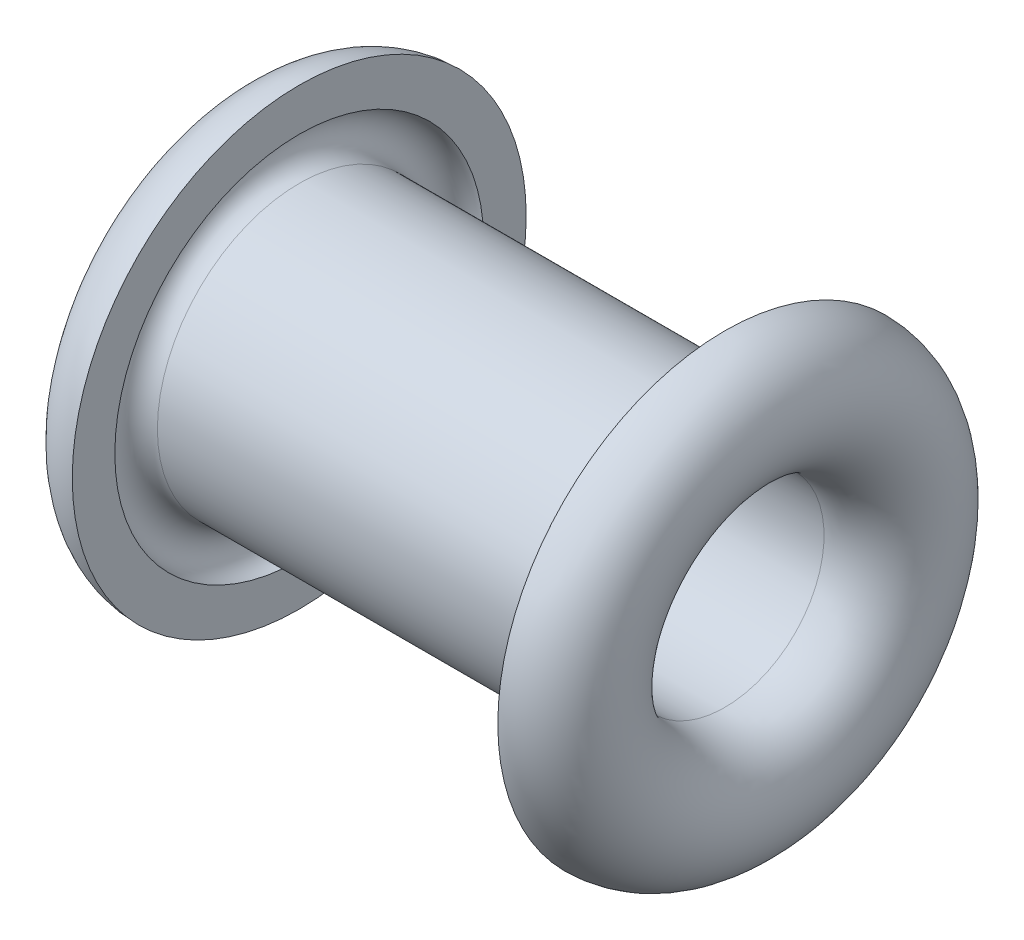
ISO-10303-21;
HEADER;
FILE_DESCRIPTION(('STEP AP214'),'2;1');
FILE_NAME('part.step','',(''),(''),'','','');
FILE_SCHEMA(('AUTOMOTIVE_DESIGN { 1 0 10303 214 1 1 1 1 }'));
ENDSEC;
DATA;
#1=APPLICATION_CONTEXT('core data for automotive mechanical design processes');
#2=APPLICATION_PROTOCOL_DEFINITION('international standard','automotive_design',2000,#1);
#3=PRODUCT_CONTEXT('',#1,'mechanical');
#4=PRODUCT('Part','Part','',(#3));
#5=PRODUCT_RELATED_PRODUCT_CATEGORY('part','',(#4));
#6=PRODUCT_DEFINITION_FORMATION('','',#4);
#7=PRODUCT_DEFINITION_CONTEXT('part definition',#1,'design');
#8=PRODUCT_DEFINITION('design','',#6,#7);
#9=PRODUCT_DEFINITION_SHAPE('','',#8);
#10=(LENGTH_UNIT() NAMED_UNIT(*) SI_UNIT(.MILLI.,.METRE.));
#11=(NAMED_UNIT(*) PLANE_ANGLE_UNIT() SI_UNIT($,.RADIAN.));
#12=(NAMED_UNIT(*) SI_UNIT($,.STERADIAN.) SOLID_ANGLE_UNIT());
#13=UNCERTAINTY_MEASURE_WITH_UNIT(LENGTH_MEASURE(1.E-05),#10,'distance_accuracy_value','');
#14=(GEOMETRIC_REPRESENTATION_CONTEXT(3) GLOBAL_UNCERTAINTY_ASSIGNED_CONTEXT((#13)) GLOBAL_UNIT_ASSIGNED_CONTEXT((#10,
#11,#12)) REPRESENTATION_CONTEXT('',''));
#15=CARTESIAN_POINT('',(0.,0.,0.));
#16=DIRECTION('',(0.,0.,1.));
#17=DIRECTION('',(1.,0.,0.));
#18=AXIS2_PLACEMENT_3D('',#15,#16,#17);
#19=CARTESIAN_POINT('',(0.,0.,0.));
#20=DIRECTION('',(-1.,0.,0.));
#21=DIRECTION('',(0.,0.,1.));
#22=AXIS2_PLACEMENT_3D('',#19,#20,#21);
#23=TOROIDAL_SURFACE('',#22,1.15,0.45);
#24=CARTESIAN_POINT('',(0.,0.,0.));
#25=DIRECTION('',(-1.,0.,0.));
#26=DIRECTION('',(0.,0.,1.));
#27=AXIS2_PLACEMENT_3D('',#24,#25,#26);
#28=CIRCLE('',#27,0.7);
#29=CARTESIAN_POINT('',(0.,0.,0.7));
#30=VERTEX_POINT('',#29);
#31=EDGE_CURVE('E10',#30,#30,#28,.T.);
#32=ORIENTED_EDGE('',*,*,#31,.F.);
#33=EDGE_LOOP('',(#32));
#34=FACE_BOUND('',#33,.T.);
#35=CARTESIAN_POINT('',(0.,0.,0.));
#36=DIRECTION('',(-1.,0.,0.));
#37=DIRECTION('',(0.,0.,1.));
#38=AXIS2_PLACEMENT_3D('',#35,#36,#37);
#39=CIRCLE('',#38,1.6);
#40=CARTESIAN_POINT('',(0.,0.,1.6));
#41=VERTEX_POINT('',#40);
#42=EDGE_CURVE('E45',#41,#41,#39,.T.);
#43=ORIENTED_EDGE('',*,*,#42,.T.);
#44=EDGE_LOOP('',(#43));
#45=FACE_BOUND('',#44,.T.);
#46=ADVANCED_FACE('F30',(#34,#45),#23,.T.);
#47=CARTESIAN_POINT('',(0.,0.,0.));
#48=DIRECTION('',(-1.,0.,0.));
#49=DIRECTION('',(0.,0.,1.));
#50=AXIS2_PLACEMENT_3D('',#47,#48,#49);
#51=CYLINDRICAL_SURFACE('',#50,0.7);
#52=ORIENTED_EDGE('',*,*,#31,.T.);
#53=EDGE_LOOP('',(#52));
#54=FACE_BOUND('',#53,.T.);
#55=CARTESIAN_POINT('',(3.,0.,0.));
#56=DIRECTION('',(-1.,0.,0.));
#57=DIRECTION('',(0.,0.,1.));
#58=AXIS2_PLACEMENT_3D('',#55,#56,#57);
#59=CIRCLE('',#58,0.7);
#60=CARTESIAN_POINT('',(3.,0.,0.7));
#61=VERTEX_POINT('',#60);
#62=EDGE_CURVE('E50',#61,#61,#59,.T.);
#63=ORIENTED_EDGE('',*,*,#62,.F.);
#64=EDGE_LOOP('',(#63));
#65=FACE_BOUND('',#64,.T.);
#66=ADVANCED_FACE('F88',(#54,#65),#51,.F.);
#67=CARTESIAN_POINT('',(0.,0.,0.));
#68=DIRECTION('',(-1.,0.,0.));
#69=DIRECTION('',(0.,0.,1.));
#70=AXIS2_PLACEMENT_3D('',#67,#68,#69);
#71=CYLINDRICAL_SURFACE('',#70,1.);
#72=CARTESIAN_POINT('',(0.,0.,0.));
#73=DIRECTION('',(-1.,0.,0.));
#74=DIRECTION('',(0.,0.,1.));
#75=AXIS2_PLACEMENT_3D('',#72,#73,#74);
#76=CIRCLE('',#75,1.);
#77=CARTESIAN_POINT('',(0.,0.,1.));
#78=VERTEX_POINT('',#77);
#79=EDGE_CURVE('E36',#78,#78,#76,.T.);
#80=ORIENTED_EDGE('',*,*,#79,.F.);
#81=EDGE_LOOP('',(#80));
#82=FACE_BOUND('',#81,.T.);
#83=CARTESIAN_POINT('',(3.,0.,0.));
#84=DIRECTION('',(-1.,0.,0.));
#85=DIRECTION('',(0.,0.,1.));
#86=AXIS2_PLACEMENT_3D('',#83,#84,#85);
#87=CIRCLE('',#86,1.);
#88=CARTESIAN_POINT('',(3.,0.,1.));
#89=VERTEX_POINT('',#88);
#90=EDGE_CURVE('E54',#89,#89,#87,.T.);
#91=ORIENTED_EDGE('',*,*,#90,.T.);
#92=EDGE_LOOP('',(#91));
#93=FACE_BOUND('',#92,.T.);
#94=ADVANCED_FACE('F93',(#82,#93),#71,.T.);
#95=CARTESIAN_POINT('',(0.,0.,0.));
#96=DIRECTION('',(-1.,0.,0.));
#97=DIRECTION('',(0.,0.,1.));
#98=AXIS2_PLACEMENT_3D('',#95,#96,#97);
#99=TOROIDAL_SURFACE('',#98,1.15,0.15);
#100=CARTESIAN_POINT('',(0.,0.,0.));
#101=DIRECTION('',(-1.,0.,0.));
#102=DIRECTION('',(0.,0.,1.));
#103=AXIS2_PLACEMENT_3D('',#100,#101,#102);
#104=CIRCLE('',#103,1.3);
#105=CARTESIAN_POINT('',(0.,0.,1.3));
#106=VERTEX_POINT('',#105);
#107=EDGE_CURVE('E40',#106,#106,#104,.T.);
#108=ORIENTED_EDGE('',*,*,#107,.F.);
#109=EDGE_LOOP('',(#108));
#110=FACE_BOUND('',#109,.T.);
#111=ORIENTED_EDGE('',*,*,#79,.T.);
#112=EDGE_LOOP('',(#111));
#113=FACE_BOUND('',#112,.T.);
#114=ADVANCED_FACE('F84',(#110,#113),#99,.F.);
#115=CARTESIAN_POINT('',(0.,1.6,0.));
#116=DIRECTION('',(-1.,0.,0.));
#117=DIRECTION('',(0.,0.,1.));
#118=AXIS2_PLACEMENT_3D('',#115,#116,#117);
#119=PLANE('',#118);
#120=ORIENTED_EDGE('',*,*,#42,.F.);
#121=EDGE_LOOP('',(#120));
#122=FACE_BOUND('',#121,.T.);
#123=ORIENTED_EDGE('',*,*,#107,.T.);
#124=EDGE_LOOP('',(#123));
#125=FACE_BOUND('',#124,.T.);
#126=ADVANCED_FACE('F75',(#122,#125),#119,.F.);
#127=CARTESIAN_POINT('',(3.,0.,0.));
#128=DIRECTION('',(1.,0.,0.));
#129=DIRECTION('',(0.,0.,1.));
#130=AXIS2_PLACEMENT_3D('',#127,#128,#129);
#131=TOROIDAL_SURFACE('',#130,1.15,0.45);
#132=ORIENTED_EDGE('',*,*,#62,.T.);
#133=EDGE_LOOP('',(#132));
#134=FACE_BOUND('',#133,.T.);
#135=CARTESIAN_POINT('',(3.,0.,0.));
#136=DIRECTION('',(-1.,0.,0.));
#137=DIRECTION('',(0.,0.,1.));
#138=AXIS2_PLACEMENT_3D('',#135,#136,#137);
#139=CIRCLE('',#138,1.6);
#140=CARTESIAN_POINT('',(3.,0.,1.6));
#141=VERTEX_POINT('',#140);
#142=EDGE_CURVE('E60',#141,#141,#139,.T.);
#143=ORIENTED_EDGE('',*,*,#142,.F.);
#144=EDGE_LOOP('',(#143));
#145=FACE_BOUND('',#144,.T.);
#146=ADVANCED_FACE('F72',(#134,#145),#131,.T.);
#147=CARTESIAN_POINT('',(3.,0.,0.));
#148=DIRECTION('',(1.,0.,0.));
#149=DIRECTION('',(0.,0.,1.));
#150=AXIS2_PLACEMENT_3D('',#147,#148,#149);
#151=TOROIDAL_SURFACE('',#150,1.15,0.15);
#152=CARTESIAN_POINT('',(3.,0.,0.));
#153=DIRECTION('',(-1.,0.,0.));
#154=DIRECTION('',(0.,0.,1.));
#155=AXIS2_PLACEMENT_3D('',#152,#153,#154);
#156=CIRCLE('',#155,1.3);
#157=CARTESIAN_POINT('',(3.,0.,1.3));
#158=VERTEX_POINT('',#157);
#159=EDGE_CURVE('E57',#158,#158,#156,.T.);
#160=ORIENTED_EDGE('',*,*,#159,.T.);
#161=EDGE_LOOP('',(#160));
#162=FACE_BOUND('',#161,.T.);
#163=ORIENTED_EDGE('',*,*,#90,.F.);
#164=EDGE_LOOP('',(#163));
#165=FACE_BOUND('',#164,.T.);
#166=ADVANCED_FACE('F74',(#162,#165),#151,.F.);
#167=CARTESIAN_POINT('',(3.,1.6,0.));
#168=DIRECTION('',(1.,0.,0.));
#169=DIRECTION('',(0.,0.,1.));
#170=AXIS2_PLACEMENT_3D('',#167,#168,#169);
#171=PLANE('',#170);
#172=ORIENTED_EDGE('',*,*,#142,.T.);
#173=EDGE_LOOP('',(#172));
#174=FACE_BOUND('',#173,.T.);
#175=ORIENTED_EDGE('',*,*,#159,.F.);
#176=EDGE_LOOP('',(#175));
#177=FACE_BOUND('',#176,.T.);
#178=ADVANCED_FACE('F69',(#174,#177),#171,.F.);
#179=CLOSED_SHELL('',(#46,#66,#94,#114,#126,#146,#166,#178));
#180=MANIFOLD_SOLID_BREP('B2',#179);
#181=ADVANCED_BREP_SHAPE_REPRESENTATION('',(#18,#180),#14);
#182=SHAPE_DEFINITION_REPRESENTATION(#9,#181);
ENDSEC;
END-ISO-10303-21;
